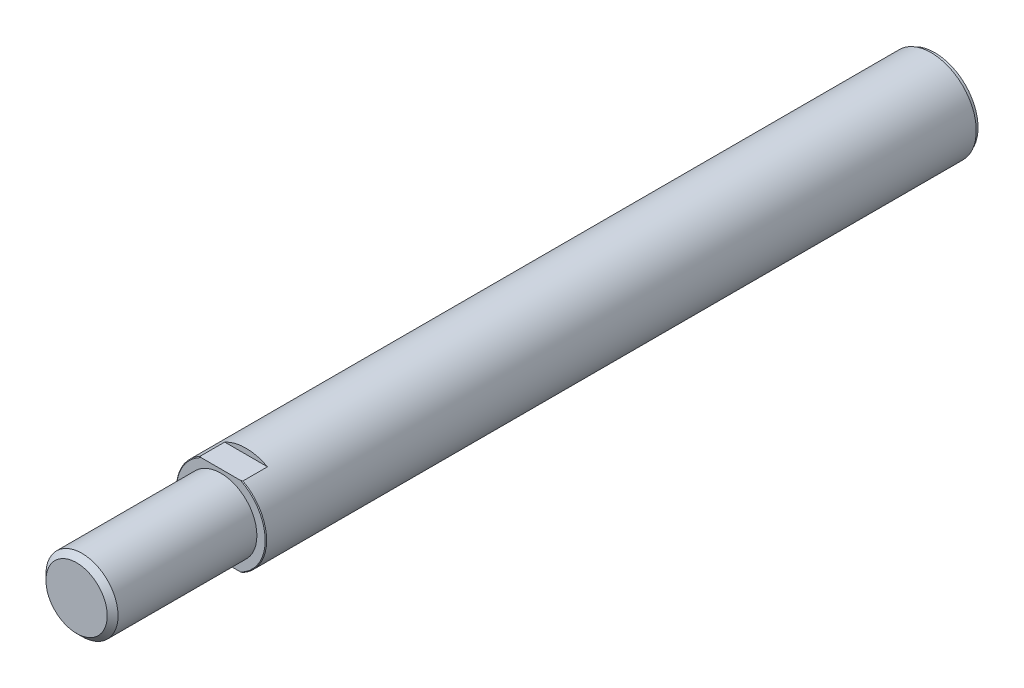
from build123d import *

# Parameters (mm, degrees)
ESBO_O1_R                       = 12.5
RESSALTO_EXTRUS_O1_DEPTH        = 238
ESBO_O2_OUTSIDE_W               = 75.122
ESBO_O2_OUTSIDE_H               = 75.122
ESBO_O2_OUTSIDE_R               = 10
CORTE_EXTRUS_O1_DEPTH           = 40
CHANFRO1_SIZE                   = 0.2
ESBO_O3_OUTSIDE_W               = 75.122
ESBO_O3_OUTSIDE_H               = 75.122
ESBO_O3_OUTSIDE_W_2             = 37.9352264
ESBO_O3_OUTSIDE_H_2             = 22
CORTE_EXTRUS_O2_DEPTH           = 7
CHANFRO2_SIZE                   = 1.5
ESBO_O4_OUTSIDE_W               = 75.122
ESBO_O4_OUTSIDE_H               = 75.122
ESBO_O4_OUTSIDE_R               = 12
CORTE_EXTRUS_O3_DEPTH           = 1
FURO_ROSCADO_DE_M12X1_751_D     = 10.2
FURO_ROSCADO_DE_M12X1_751_DEPTH = 32.75
FURO_ROSCADO_DE_M12X1_751_TIP   = 3.064389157


with BuildPart() as part:
    # Esbo_o1 → Ressalto-extrus_o1 (new body)
    with BuildSketch(Plane.XY):
        with Locations(Location((0, 0, 0), (0, 0, 180))):
            Circle(ESBO_O1_R)
    extrude(amount=RESSALTO_EXTRUS_O1_DEPTH)

    # Esbo_o2 outside → Corte-extrus_o1 (cut)
    with BuildSketch(Plane.XY.offset(238)):
        Rectangle(ESBO_O2_OUTSIDE_W, ESBO_O2_OUTSIDE_H)
        Circle(ESBO_O2_OUTSIDE_R, mode=Mode.SUBTRACT)
    extrude(amount=-CORTE_EXTRUS_O1_DEPTH, mode=Mode.SUBTRACT)

    # Chanfro1
    chanfro1_edges = [part.edges().sort_by_distance(p)[0] for p in [
        (12.5, 0, 198),
    ]]
    chamfer(chanfro1_edges, length=CHANFRO1_SIZE)

    # Esbo_o3 outside → Corte-extrus_o2 (cut)
    with BuildSketch(Plane.XY.offset(198)):
        Rectangle(ESBO_O3_OUTSIDE_W, ESBO_O3_OUTSIDE_H)
        Rectangle(ESBO_O3_OUTSIDE_W_2, ESBO_O3_OUTSIDE_H_2, mode=Mode.SUBTRACT)
    extrude(amount=-CORTE_EXTRUS_O2_DEPTH, mode=Mode.SUBTRACT)

    # Chanfro2
    chanfro2_edges = [part.edges().sort_by_distance(p)[0] for p in [
        (-10, 0, 238),
    ]]
    chamfer(chanfro2_edges, length=CHANFRO2_SIZE)

    # Esbo_o4 outside → Corte-extrus_o3 (cut)
    with BuildSketch(Plane(origin=(0, 0, 0), x_dir=(-1, 0, 0), z_dir=(0, 0, -1))):
        Rectangle(ESBO_O4_OUTSIDE_W, ESBO_O4_OUTSIDE_H)
        Circle(ESBO_O4_OUTSIDE_R, mode=Mode.SUBTRACT)
    extrude(amount=-CORTE_EXTRUS_O3_DEPTH, mode=Mode.SUBTRACT)

    # Furo roscado de M12x1.751
    with Locations(Plane(origin=(0, 0, 0), x_dir=(-1, 0, 0), z_dir=(0, 0, -1))):
        with Locations((0, 0)):
            Hole(FURO_ROSCADO_DE_M12X1_751_D / 2, depth=FURO_ROSCADO_DE_M12X1_751_DEPTH)
            with Locations((0, 0, -(FURO_ROSCADO_DE_M12X1_751_DEPTH + FURO_ROSCADO_DE_M12X1_751_TIP / 2))):  # 118° drill point
                Cone(0, FURO_ROSCADO_DE_M12X1_751_D / 2, FURO_ROSCADO_DE_M12X1_751_TIP, mode=Mode.SUBTRACT)


solid = part.part
